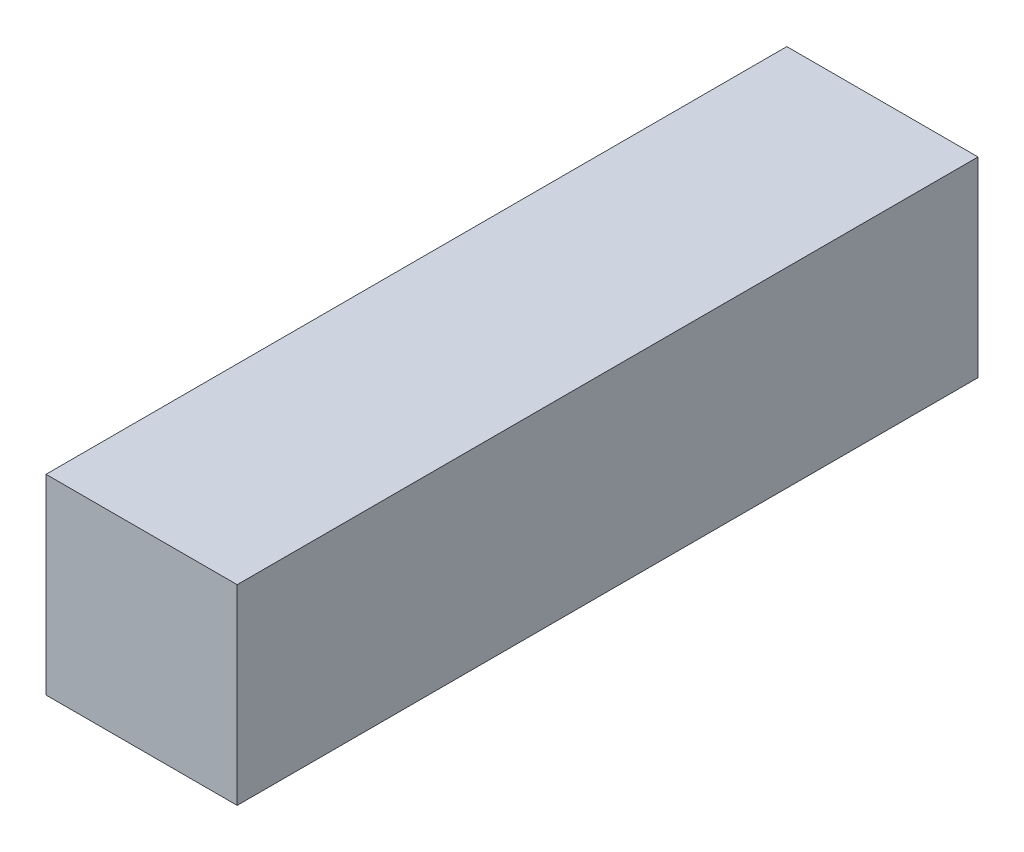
from build123d import *

# Parameters (mm, degrees)
BOSS_EXTRUDE1_DEPTH = 3
SKETCH2_W           = 4
SKETCH2_H           = 15.5
BOSS_EXTRUDE2_DEPTH = 1
CUT_EXTRUDE1_DEPTH  = 0.25
CUT_EXTRUDE7_DEPTH  = 6


with BuildPart() as part:
    # Sketch1 → Boss-Extrude1 (new body)
    with BuildSketch(Plane(origin=(0, 0, 0), x_dir=(1, 0, 0), z_dir=(0, 1, 0))):
        Polygon((-1, -7.25), (1, -7.25), (1, 7.25), (2, 7.25), (2, -7.25), (2, -8.25), (1, -8.25), (-2, -8.25), (-2, 7.25), (-1, 7.25), align=None)
    extrude(amount=BOSS_EXTRUDE1_DEPTH)

    # Sketch2 → Boss-Extrude2 (add)
    with BuildSketch(Plane(origin=(0, 3, 0), x_dir=(1, 0, 0), z_dir=(0, 1, 0))):
        with Locations((0, -0.5)):
            Rectangle(SKETCH2_W, SKETCH2_H)
    extrude(amount=BOSS_EXTRUDE2_DEPTH)

    # Sketch3 → Cut-Extrude1 (cut)
    with BuildSketch(Plane.XZ):
        Polygon((-1, 7.25), (1, 7.25), (1, -7.25), (1.5, -7.25), (1.5, 7.717200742), (-1.5, 7.717200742), (-1.5, -7.25), (-1, -7.25), align=None)
    extrude(amount=-CUT_EXTRUDE1_DEPTH, mode=Mode.SUBTRACT)

    # Sketch9 → Cut-Extrude7 (cut)
    with BuildSketch(Plane(origin=(31.168539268, -3, 26.546214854), x_dir=(-0.7071067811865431, 0, 0.7071067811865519), z_dir=(0, -1, 0))):
        Polygon((7.620004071, 34.212873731), (9.865582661, 36.458452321), (9.847893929, 36.476141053), (-10.673980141, 56.998015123), (-12.919044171, 54.752951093), (7.602829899, 34.231077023), align=None)
    extrude(amount=-CUT_EXTRUDE7_DEPTH, mode=Mode.SUBTRACT)


solid = part.part
